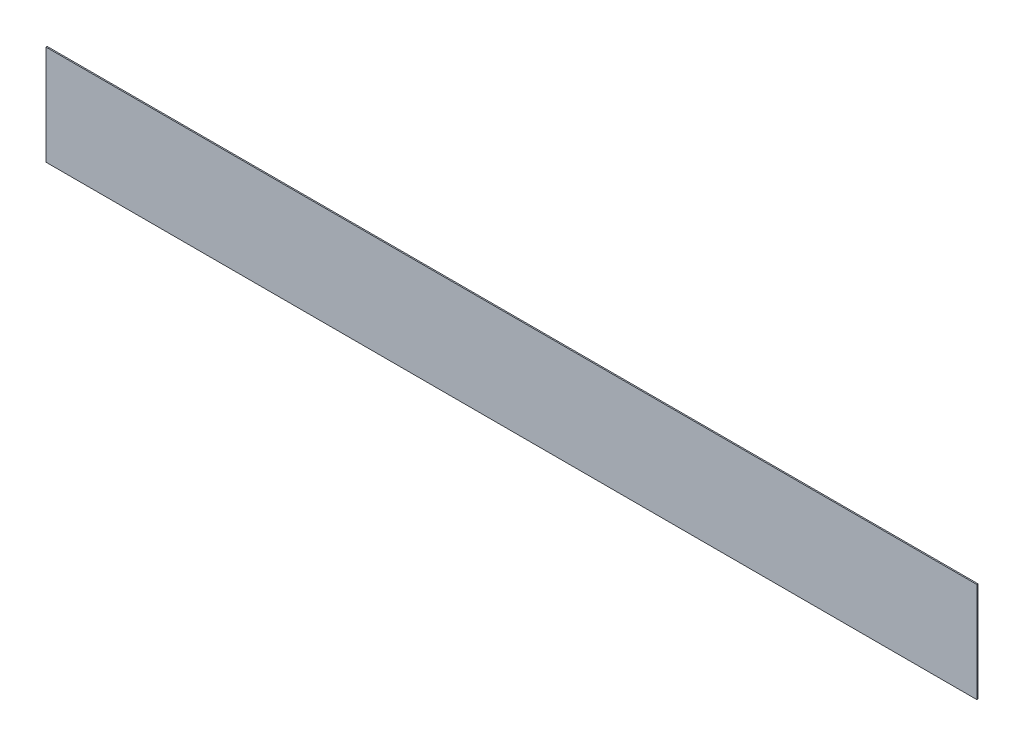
from build123d import *

# Parameters (mm, degrees)
ESQUISSE1_W        = 1540
ESQUISSE1_H        = 165
BOSS_EXTRU_1_DEPTH = 2


with BuildPart() as part:
    # Esquisse1 → Boss.-Extru.1 (new body)
    with BuildSketch(Plane.XY):
        with Locations((651.868931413, -43.647563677)):
            Rectangle(ESQUISSE1_W, ESQUISSE1_H)
    extrude(amount=BOSS_EXTRU_1_DEPTH)


solid = part.part
